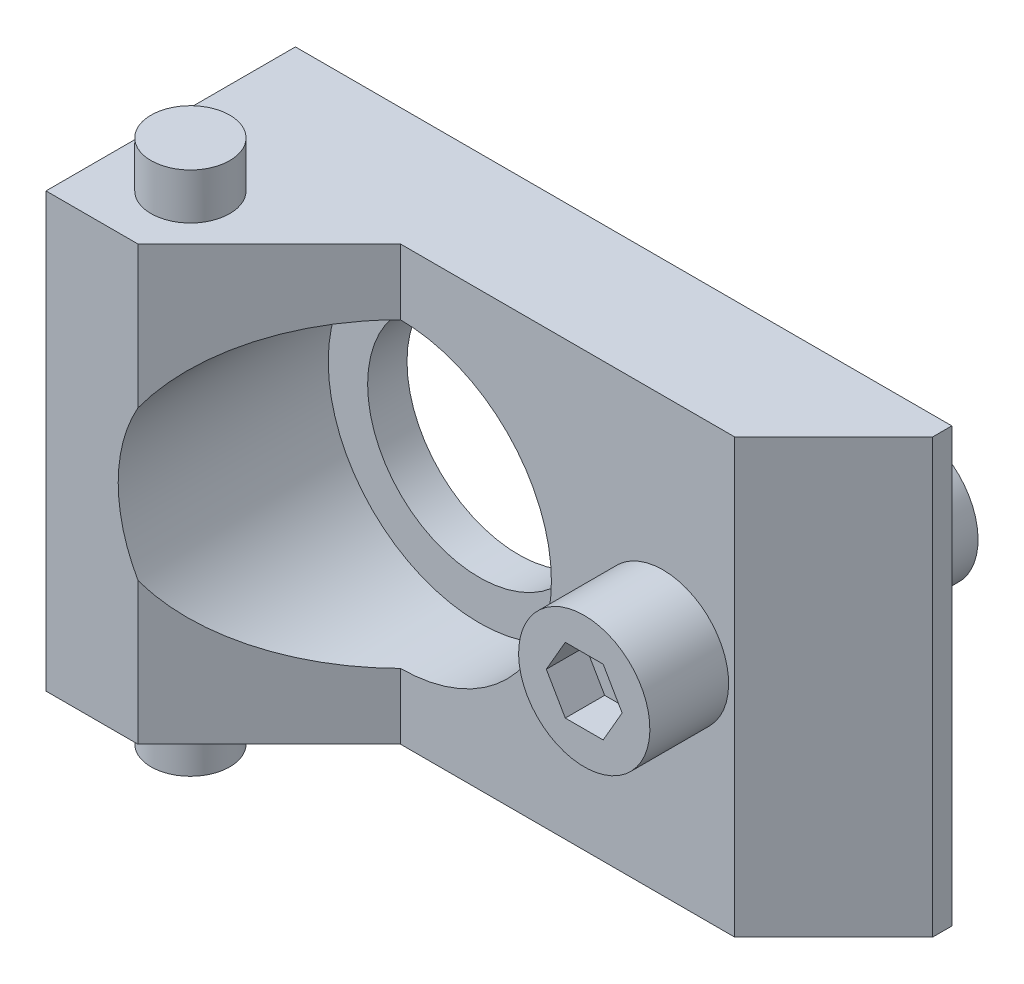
ISO-10303-21;
HEADER;
FILE_DESCRIPTION(('STEP AP214'),'2;1');
FILE_NAME('part.step','',(''),(''),'','','');
FILE_SCHEMA(('AUTOMOTIVE_DESIGN { 1 0 10303 214 1 1 1 1 }'));
ENDSEC;
DATA;
#1=APPLICATION_CONTEXT('core data for automotive mechanical design processes');
#2=APPLICATION_PROTOCOL_DEFINITION('international standard','automotive_design',2000,#1);
#3=PRODUCT_CONTEXT('',#1,'mechanical');
#4=PRODUCT('Part','Part','',(#3));
#5=PRODUCT_RELATED_PRODUCT_CATEGORY('part','',(#4));
#6=PRODUCT_DEFINITION_FORMATION('','',#4);
#7=PRODUCT_DEFINITION_CONTEXT('part definition',#1,'design');
#8=PRODUCT_DEFINITION('design','',#6,#7);
#9=PRODUCT_DEFINITION_SHAPE('','',#8);
#10=(LENGTH_UNIT() NAMED_UNIT(*) SI_UNIT(.MILLI.,.METRE.));
#11=(NAMED_UNIT(*) PLANE_ANGLE_UNIT() SI_UNIT($,.RADIAN.));
#12=(NAMED_UNIT(*) SI_UNIT($,.STERADIAN.) SOLID_ANGLE_UNIT());
#13=UNCERTAINTY_MEASURE_WITH_UNIT(LENGTH_MEASURE(1.E-05),#10,'distance_accuracy_value','');
#14=(GEOMETRIC_REPRESENTATION_CONTEXT(3) GLOBAL_UNCERTAINTY_ASSIGNED_CONTEXT((#13)) GLOBAL_UNIT_ASSIGNED_CONTEXT((#10,
#11,#12)) REPRESENTATION_CONTEXT('',''));
#15=CARTESIAN_POINT('',(0.,0.,0.));
#16=DIRECTION('',(0.,0.,1.));
#17=DIRECTION('',(1.,0.,0.));
#18=AXIS2_PLACEMENT_3D('',#15,#16,#17);
#19=CARTESIAN_POINT('',(0.,0.,5.));
#20=DIRECTION('',(0.,0.,-1.));
#21=DIRECTION('',(0.,-1.,0.));
#22=AXIS2_PLACEMENT_3D('',#19,#20,#21);
#23=CYLINDRICAL_SURFACE('',#22,5.);
#24=CARTESIAN_POINT('',(0.,0.,-10.));
#25=DIRECTION('',(0.,0.,-1.));
#26=DIRECTION('',(-1.,0.,0.));
#27=AXIS2_PLACEMENT_3D('',#24,#25,#26);
#28=CIRCLE('',#27,5.);
#29=CARTESIAN_POINT('',(-5.,0.,-10.));
#30=VERTEX_POINT('',#29);
#31=EDGE_CURVE('E21',#30,#30,#28,.T.);
#32=ORIENTED_EDGE('',*,*,#31,.F.);
#33=EDGE_LOOP('',(#32));
#34=FACE_BOUND('',#33,.T.);
#35=CARTESIAN_POINT('',(0.,0.,0.));
#36=DIRECTION('',(0.,0.,1.));
#37=DIRECTION('',(0.,-1.,0.));
#38=AXIS2_PLACEMENT_3D('',#35,#36,#37);
#39=CIRCLE('',#38,5.);
#40=CARTESIAN_POINT('',(0.,-5.,0.));
#41=VERTEX_POINT('',#40);
#42=EDGE_CURVE('E9',#41,#41,#39,.T.);
#43=ORIENTED_EDGE('',*,*,#42,.F.);
#44=EDGE_LOOP('',(#43));
#45=FACE_BOUND('',#44,.T.);
#46=ADVANCED_FACE('F14',(#34,#45),#23,.T.);
#47=CARTESIAN_POINT('',(0.,0.,-10.));
#48=DIRECTION('',(0.,0.,1.));
#49=DIRECTION('',(0.,1.,0.));
#50=AXIS2_PLACEMENT_3D('',#47,#48,#49);
#51=PLANE('',#50);
#52=ORIENTED_EDGE('',*,*,#31,.T.);
#53=EDGE_LOOP('',(#52));
#54=FACE_BOUND('',#53,.T.);
#55=ADVANCED_FACE('F226',(#54),#51,.F.);
#56=CARTESIAN_POINT('',(-1.44337567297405,2.5,12.));
#57=DIRECTION('',(0.,0.,1.));
#58=DIRECTION('',(0.,1.,0.));
#59=AXIS2_PLACEMENT_3D('',#56,#57,#58);
#60=PLANE('',#59);
#61=DIRECTION('',(0.5,0.866025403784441,0.));
#62=VECTOR('',#61,1.);
#63=CARTESIAN_POINT('',(-2.8867513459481,0.,12.));
#64=LINE('',#63,#62);
#65=CARTESIAN_POINT('',(-2.8867513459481,0.,12.));
#66=VERTEX_POINT('',#65);
#67=CARTESIAN_POINT('',(-1.44337567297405,2.5,12.));
#68=VERTEX_POINT('',#67);
#69=EDGE_CURVE('E177',#66,#68,#64,.T.);
#70=ORIENTED_EDGE('',*,*,#69,.F.);
#71=DIRECTION('',(0.5,-0.866025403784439,0.));
#72=VECTOR('',#71,1.);
#73=CARTESIAN_POINT('',(-2.8867513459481,0.,12.));
#74=LINE('',#73,#72);
#75=CARTESIAN_POINT('',(-1.44337567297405,-2.5,12.));
#76=VERTEX_POINT('',#75);
#77=EDGE_CURVE('E191',#66,#76,#74,.T.);
#78=ORIENTED_EDGE('',*,*,#77,.T.);
#79=DIRECTION('',(1.,0.,0.));
#80=VECTOR('',#79,1.);
#81=CARTESIAN_POINT('',(-1.44337567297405,-2.5,12.));
#82=LINE('',#81,#80);
#83=CARTESIAN_POINT('',(1.44337567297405,-2.5,12.));
#84=VERTEX_POINT('',#83);
#85=EDGE_CURVE('E194',#76,#84,#82,.T.);
#86=ORIENTED_EDGE('',*,*,#85,.T.);
#87=DIRECTION('',(-0.5,-0.866025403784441,0.));
#88=VECTOR('',#87,1.);
#89=CARTESIAN_POINT('',(2.88675134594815,0.,12.));
#90=LINE('',#89,#88);
#91=CARTESIAN_POINT('',(2.88675134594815,0.,12.));
#92=VERTEX_POINT('',#91);
#93=EDGE_CURVE('E197',#92,#84,#90,.T.);
#94=ORIENTED_EDGE('',*,*,#93,.F.);
#95=DIRECTION('',(-0.5,0.866025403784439,0.));
#96=VECTOR('',#95,1.);
#97=CARTESIAN_POINT('',(2.88675134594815,0.,12.));
#98=LINE('',#97,#96);
#99=CARTESIAN_POINT('',(1.44337567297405,2.5,12.));
#100=VERTEX_POINT('',#99);
#101=EDGE_CURVE('E200',#92,#100,#98,.T.);
#102=ORIENTED_EDGE('',*,*,#101,.T.);
#103=DIRECTION('',(-1.,0.,0.));
#104=VECTOR('',#103,1.);
#105=CARTESIAN_POINT('',(1.44337567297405,2.5,12.));
#106=LINE('',#105,#104);
#107=EDGE_CURVE('E203',#100,#68,#106,.T.);
#108=ORIENTED_EDGE('',*,*,#107,.T.);
#109=EDGE_LOOP('',(#70,#78,#86,#94,#102,#108));
#110=FACE_BOUND('',#109,.T.);
#111=ADVANCED_FACE('F249',(#110),#60,.T.);
#112=CARTESIAN_POINT('',(-1.44337567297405,-2.5,12.));
#113=DIRECTION('',(0.,-1.,0.));
#114=DIRECTION('',(1.,0.,0.));
#115=AXIS2_PLACEMENT_3D('',#112,#113,#114);
#116=PLANE('',#115);
#117=DIRECTION('',(0.,0.,1.));
#118=VECTOR('',#117,1.);
#119=CARTESIAN_POINT('',(-1.44337567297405,-2.5,12.));
#120=LINE('',#119,#118);
#121=CARTESIAN_POINT('',(-1.44337567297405,-2.5,15.));
#122=VERTEX_POINT('',#121);
#123=EDGE_CURVE('E208',#76,#122,#120,.T.);
#124=ORIENTED_EDGE('',*,*,#123,.T.);
#125=DIRECTION('',(1.,0.,0.));
#126=VECTOR('',#125,1.);
#127=CARTESIAN_POINT('',(-1.44337567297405,-2.5,15.));
#128=LINE('',#127,#126);
#129=CARTESIAN_POINT('',(1.44337567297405,-2.5,15.));
#130=VERTEX_POINT('',#129);
#131=EDGE_CURVE('E178',#122,#130,#128,.T.);
#132=ORIENTED_EDGE('',*,*,#131,.T.);
#133=DIRECTION('',(0.,0.,1.));
#134=VECTOR('',#133,1.);
#135=CARTESIAN_POINT('',(1.44337567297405,-2.5,12.));
#136=LINE('',#135,#134);
#137=EDGE_CURVE('E210',#84,#130,#136,.T.);
#138=ORIENTED_EDGE('',*,*,#137,.F.);
#139=ORIENTED_EDGE('',*,*,#85,.F.);
#140=EDGE_LOOP('',(#124,#132,#138,#139));
#141=FACE_BOUND('',#140,.T.);
#142=ADVANCED_FACE('F251',(#141),#116,.F.);
#143=CARTESIAN_POINT('',(2.88675134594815,0.,12.));
#144=DIRECTION('',(-0.866025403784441,0.5,0.));
#145=DIRECTION('',(-0.5,-0.866025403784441,0.));
#146=AXIS2_PLACEMENT_3D('',#143,#144,#145);
#147=PLANE('',#146);
#148=ORIENTED_EDGE('',*,*,#137,.T.);
#149=DIRECTION('',(-0.5,-0.866025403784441,0.));
#150=VECTOR('',#149,1.);
#151=CARTESIAN_POINT('',(2.88675134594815,0.,15.));
#152=LINE('',#151,#150);
#153=CARTESIAN_POINT('',(2.88675134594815,0.,15.));
#154=VERTEX_POINT('',#153);
#155=EDGE_CURVE('E181',#154,#130,#152,.T.);
#156=ORIENTED_EDGE('',*,*,#155,.F.);
#157=DIRECTION('',(0.,0.,1.));
#158=VECTOR('',#157,1.);
#159=CARTESIAN_POINT('',(2.88675134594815,0.,12.));
#160=LINE('',#159,#158);
#161=EDGE_CURVE('E212',#92,#154,#160,.T.);
#162=ORIENTED_EDGE('',*,*,#161,.F.);
#163=ORIENTED_EDGE('',*,*,#93,.T.);
#164=EDGE_LOOP('',(#148,#156,#162,#163));
#165=FACE_BOUND('',#164,.T.);
#166=ADVANCED_FACE('F259',(#165),#147,.T.);
#167=CARTESIAN_POINT('',(2.88675134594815,0.,12.));
#168=DIRECTION('',(0.866025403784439,0.5,0.));
#169=DIRECTION('',(-0.5,0.866025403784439,0.));
#170=AXIS2_PLACEMENT_3D('',#167,#168,#169);
#171=PLANE('',#170);
#172=ORIENTED_EDGE('',*,*,#161,.T.);
#173=DIRECTION('',(-0.5,0.866025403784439,0.));
#174=VECTOR('',#173,1.);
#175=CARTESIAN_POINT('',(2.88675134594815,0.,15.));
#176=LINE('',#175,#174);
#177=CARTESIAN_POINT('',(1.44337567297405,2.5,15.));
#178=VERTEX_POINT('',#177);
#179=EDGE_CURVE('E184',#154,#178,#176,.T.);
#180=ORIENTED_EDGE('',*,*,#179,.T.);
#181=DIRECTION('',(0.,0.,1.));
#182=VECTOR('',#181,1.);
#183=CARTESIAN_POINT('',(1.44337567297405,2.5,12.));
#184=LINE('',#183,#182);
#185=EDGE_CURVE('E214',#100,#178,#184,.T.);
#186=ORIENTED_EDGE('',*,*,#185,.F.);
#187=ORIENTED_EDGE('',*,*,#101,.F.);
#188=EDGE_LOOP('',(#172,#180,#186,#187));
#189=FACE_BOUND('',#188,.T.);
#190=ADVANCED_FACE('F277',(#189),#171,.F.);
#191=CARTESIAN_POINT('',(1.44337567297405,2.5,12.));
#192=DIRECTION('',(0.,1.,0.));
#193=DIRECTION('',(-1.,0.,0.));
#194=AXIS2_PLACEMENT_3D('',#191,#192,#193);
#195=PLANE('',#194);
#196=ORIENTED_EDGE('',*,*,#185,.T.);
#197=DIRECTION('',(-1.,0.,0.));
#198=VECTOR('',#197,1.);
#199=CARTESIAN_POINT('',(1.44337567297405,2.5,15.));
#200=LINE('',#199,#198);
#201=CARTESIAN_POINT('',(-1.44337567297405,2.5,15.));
#202=VERTEX_POINT('',#201);
#203=EDGE_CURVE('E187',#178,#202,#200,.T.);
#204=ORIENTED_EDGE('',*,*,#203,.T.);
#205=DIRECTION('',(0.,0.,1.));
#206=VECTOR('',#205,1.);
#207=CARTESIAN_POINT('',(-1.44337567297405,2.5,12.));
#208=LINE('',#207,#206);
#209=EDGE_CURVE('E216',#68,#202,#208,.T.);
#210=ORIENTED_EDGE('',*,*,#209,.F.);
#211=ORIENTED_EDGE('',*,*,#107,.F.);
#212=EDGE_LOOP('',(#196,#204,#210,#211));
#213=FACE_BOUND('',#212,.T.);
#214=ADVANCED_FACE('F270',(#213),#195,.F.);
#215=CARTESIAN_POINT('',(-2.8867513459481,0.,12.));
#216=DIRECTION('',(0.866025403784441,-0.5,0.));
#217=DIRECTION('',(0.5,0.866025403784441,0.));
#218=AXIS2_PLACEMENT_3D('',#215,#216,#217);
#219=PLANE('',#218);
#220=ORIENTED_EDGE('',*,*,#209,.T.);
#221=DIRECTION('',(0.5,0.866025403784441,0.));
#222=VECTOR('',#221,1.);
#223=CARTESIAN_POINT('',(-2.8867513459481,0.,15.));
#224=LINE('',#223,#222);
#225=CARTESIAN_POINT('',(-2.8867513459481,0.,15.));
#226=VERTEX_POINT('',#225);
#227=EDGE_CURVE('E28',#226,#202,#224,.T.);
#228=ORIENTED_EDGE('',*,*,#227,.F.);
#229=DIRECTION('',(0.,0.,1.));
#230=VECTOR('',#229,1.);
#231=CARTESIAN_POINT('',(-2.8867513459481,0.,12.));
#232=LINE('',#231,#230);
#233=EDGE_CURVE('E32',#66,#226,#232,.T.);
#234=ORIENTED_EDGE('',*,*,#233,.F.);
#235=ORIENTED_EDGE('',*,*,#69,.T.);
#236=EDGE_LOOP('',(#220,#228,#234,#235));
#237=FACE_BOUND('',#236,.T.);
#238=ADVANCED_FACE('F266',(#237),#219,.T.);
#239=CARTESIAN_POINT('',(-2.8867513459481,0.,12.));
#240=DIRECTION('',(-0.866025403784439,-0.5,0.));
#241=DIRECTION('',(0.5,-0.866025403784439,0.));
#242=AXIS2_PLACEMENT_3D('',#239,#240,#241);
#243=PLANE('',#242);
#244=ORIENTED_EDGE('',*,*,#77,.F.);
#245=ORIENTED_EDGE('',*,*,#233,.T.);
#246=DIRECTION('',(0.5,-0.866025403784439,0.));
#247=VECTOR('',#246,1.);
#248=CARTESIAN_POINT('',(-2.8867513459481,0.,15.));
#249=LINE('',#248,#247);
#250=EDGE_CURVE('E174',#226,#122,#249,.T.);
#251=ORIENTED_EDGE('',*,*,#250,.T.);
#252=ORIENTED_EDGE('',*,*,#123,.F.);
#253=EDGE_LOOP('',(#244,#245,#251,#252));
#254=FACE_BOUND('',#253,.T.);
#255=ADVANCED_FACE('F269',(#254),#243,.F.);
#256=CARTESIAN_POINT('',(0.,0.,15.));
#257=DIRECTION('',(0.,0.,1.));
#258=DIRECTION('',(0.,1.,0.));
#259=AXIS2_PLACEMENT_3D('',#256,#257,#258);
#260=PLANE('',#259);
#261=CARTESIAN_POINT('',(0.,0.,15.));
#262=DIRECTION('',(0.,0.,1.));
#263=DIRECTION('',(0.,1.,0.));
#264=AXIS2_PLACEMENT_3D('',#261,#262,#263);
#265=CIRCLE('',#264,5.);
#266=CARTESIAN_POINT('',(0.,5.,15.));
#267=VERTEX_POINT('',#266);
#268=EDGE_CURVE('E221',#267,#267,#265,.T.);
#269=ORIENTED_EDGE('',*,*,#268,.T.);
#270=EDGE_LOOP('',(#269));
#271=FACE_BOUND('',#270,.T.);
#272=ORIENTED_EDGE('',*,*,#250,.F.);
#273=ORIENTED_EDGE('',*,*,#227,.T.);
#274=ORIENTED_EDGE('',*,*,#203,.F.);
#275=ORIENTED_EDGE('',*,*,#179,.F.);
#276=ORIENTED_EDGE('',*,*,#155,.T.);
#277=ORIENTED_EDGE('',*,*,#131,.F.);
#278=EDGE_LOOP('',(#272,#273,#274,#275,#276,#277));
#279=FACE_BOUND('',#278,.T.);
#280=ADVANCED_FACE('F272',(#271,#279),#260,.T.);
#281=CARTESIAN_POINT('',(-31.5,20.,13.5));
#282=DIRECTION('',(0.,-1.,0.));
#283=DIRECTION('',(0.381849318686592,0.,0.924224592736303));
#284=AXIS2_PLACEMENT_3D('',#281,#282,#283);
#285=PLANE('',#284);
#286=CARTESIAN_POINT('',(-31.5,20.,13.5));
#287=DIRECTION('',(0.,-1.,0.));
#288=DIRECTION('',(0.381849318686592,0.,0.924224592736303));
#289=AXIS2_PLACEMENT_3D('',#286,#287,#288);
#290=CIRCLE('',#289,3.);
#291=CARTESIAN_POINT('',(-30.3544520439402,20.,16.2726737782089));
#292=VERTEX_POINT('',#291);
#293=EDGE_CURVE('E168',#292,#292,#290,.T.);
#294=ORIENTED_EDGE('',*,*,#293,.F.);
#295=EDGE_LOOP('',(#294));
#296=FACE_BOUND('',#295,.T.);
#297=ADVANCED_FACE('F292',(#296),#285,.F.);
#298=CARTESIAN_POINT('',(-31.5,-20.,13.5));
#299=DIRECTION('',(0.,-1.,0.));
#300=DIRECTION('',(0.860899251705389,0.,0.508775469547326));
#301=AXIS2_PLACEMENT_3D('',#298,#299,#300);
#302=PLANE('',#301);
#303=CARTESIAN_POINT('',(-31.5,-20.,13.5));
#304=DIRECTION('',(0.,-1.,0.));
#305=DIRECTION('',(0.860899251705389,0.,0.508775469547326));
#306=AXIS2_PLACEMENT_3D('',#303,#304,#305);
#307=CIRCLE('',#306,3.);
#308=CARTESIAN_POINT('',(-28.9173022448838,-20.,15.026326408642));
#309=VERTEX_POINT('',#308);
#310=EDGE_CURVE('E129',#309,#309,#307,.T.);
#311=ORIENTED_EDGE('',*,*,#310,.T.);
#312=EDGE_LOOP('',(#311));
#313=FACE_BOUND('',#312,.T.);
#314=ADVANCED_FACE('F289',(#313),#302,.T.);
#315=CARTESIAN_POINT('',(0.,0.,17.));
#316=DIRECTION('',(0.,0.,1.));
#317=DIRECTION('',(0.,1.,0.));
#318=AXIS2_PLACEMENT_3D('',#315,#316,#317);
#319=CYLINDRICAL_SURFACE('',#318,5.);
#320=CARTESIAN_POINT('',(0.,0.,9.));
#321=DIRECTION('',(0.,0.,1.));
#322=DIRECTION('',(0.,1.,0.));
#323=AXIS2_PLACEMENT_3D('',#320,#321,#322);
#324=CIRCLE('',#323,5.);
#325=CARTESIAN_POINT('',(0.,5.,9.));
#326=VERTEX_POINT('',#325);
#327=EDGE_CURVE('E218',#326,#326,#324,.T.);
#328=ORIENTED_EDGE('',*,*,#327,.T.);
#329=EDGE_LOOP('',(#328));
#330=FACE_BOUND('',#329,.T.);
#331=ORIENTED_EDGE('',*,*,#268,.F.);
#332=EDGE_LOOP('',(#331));
#333=FACE_BOUND('',#332,.T.);
#334=ADVANCED_FACE('F285',(#330,#333),#319,.T.);
#335=CARTESIAN_POINT('',(-20.,0.,3.));
#336=DIRECTION('',(0.,0.,1.));
#337=DIRECTION('',(-1.,0.,0.));
#338=AXIS2_PLACEMENT_3D('',#335,#336,#337);
#339=CYLINDRICAL_SURFACE('',#338,11.5);
#340=CARTESIAN_POINT('',(-20.,0.,3.));
#341=DIRECTION('',(0.,0.,1.));
#342=DIRECTION('',(-1.,0.,0.));
#343=AXIS2_PLACEMENT_3D('',#340,#341,#342);
#344=CIRCLE('',#343,11.5);
#345=CARTESIAN_POINT('',(-31.5,0.,3.));
#346=VERTEX_POINT('',#345);
#347=EDGE_CURVE('E157',#346,#346,#344,.T.);
#348=ORIENTED_EDGE('',*,*,#347,.F.);
#349=EDGE_LOOP('',(#348));
#350=FACE_BOUND('',#349,.T.);
#351=CARTESIAN_POINT('',(-20.,0.,19.));
#352=DIRECTION('',(0.,0.,1.));
#353=DIRECTION('',(-1.,0.,0.));
#354=AXIS2_PLACEMENT_3D('',#351,#352,#353);
#355=CIRCLE('',#354,11.5);
#356=CARTESIAN_POINT('',(-30.,-5.67890834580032,19.));
#357=VERTEX_POINT('',#356);
#358=CARTESIAN_POINT('',(-30.,5.67890834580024,19.));
#359=VERTEX_POINT('',#358);
#360=EDGE_CURVE('E416',#357,#359,#355,.F.);
#361=ORIENTED_EDGE('',*,*,#360,.F.);
#362=CARTESIAN_POINT('',(-20.,0.,9.00000000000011));
#363=DIRECTION('',(-0.707106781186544,0.,-0.707106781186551));
#364=DIRECTION('',(-0.707106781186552,0.,0.707106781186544));
#365=AXIS2_PLACEMENT_3D('',#362,#363,#364);
#366=ELLIPSE('',#365,16.2634559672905,11.5);
#367=CARTESIAN_POINT('',(-20.,-11.5,9.));
#368=VERTEX_POINT('',#367);
#369=EDGE_CURVE('E163',#357,#368,#366,.F.);
#370=ORIENTED_EDGE('',*,*,#369,.T.);
#371=CARTESIAN_POINT('',(-20.,0.,9.));
#372=DIRECTION('',(0.,0.,-1.));
#373=DIRECTION('',(1.,0.,0.));
#374=AXIS2_PLACEMENT_3D('',#371,#372,#373);
#375=CIRCLE('',#374,11.5);
#376=CARTESIAN_POINT('',(-20.,11.5,9.));
#377=VERTEX_POINT('',#376);
#378=EDGE_CURVE('E147',#368,#377,#375,.F.);
#379=ORIENTED_EDGE('',*,*,#378,.T.);
#380=EDGE_CURVE('E160',#377,#359,#366,.F.);
#381=ORIENTED_EDGE('',*,*,#380,.T.);
#382=EDGE_LOOP('',(#361,#370,#379,#381));
#383=FACE_BOUND('',#382,.T.);
#384=ADVANCED_FACE('F288',(#350,#383),#339,.F.);
#385=CARTESIAN_POINT('',(-20.,0.,3.));
#386=DIRECTION('',(0.,0.,1.));
#387=DIRECTION('',(-1.,0.,0.));
#388=AXIS2_PLACEMENT_3D('',#385,#386,#387);
#389=PLANE('',#388);
#390=ORIENTED_EDGE('',*,*,#347,.T.);
#391=EDGE_LOOP('',(#390));
#392=FACE_BOUND('',#391,.T.);
#393=CARTESIAN_POINT('',(-20.,0.,3.));
#394=DIRECTION('',(0.,0.,1.));
#395=DIRECTION('',(-1.,0.,0.));
#396=AXIS2_PLACEMENT_3D('',#393,#394,#395);
#397=CIRCLE('',#396,8.5);
#398=CARTESIAN_POINT('',(-28.5,0.,3.));
#399=VERTEX_POINT('',#398);
#400=EDGE_CURVE('E153',#399,#399,#397,.F.);
#401=ORIENTED_EDGE('',*,*,#400,.T.);
#402=EDGE_LOOP('',(#401));
#403=FACE_BOUND('',#402,.T.);
#404=ADVANCED_FACE('F359',(#392,#403),#389,.T.);
#405=CARTESIAN_POINT('',(-31.5,10.,13.5));
#406=DIRECTION('',(0.,1.,0.));
#407=DIRECTION('',(-0.381849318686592,0.,-0.924224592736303));
#408=AXIS2_PLACEMENT_3D('',#405,#406,#407);
#409=CYLINDRICAL_SURFACE('',#408,3.);
#410=ORIENTED_EDGE('',*,*,#293,.T.);
#411=EDGE_LOOP('',(#410));
#412=FACE_BOUND('',#411,.T.);
#413=CARTESIAN_POINT('',(-31.5,16.5,13.5));
#414=DIRECTION('',(0.,-1.,0.));
#415=DIRECTION('',(0.,0.,-1.));
#416=AXIS2_PLACEMENT_3D('',#413,#414,#415);
#417=CIRCLE('',#416,3.);
#418=CARTESIAN_POINT('',(-31.5,16.5,10.5));
#419=VERTEX_POINT('',#418);
#420=EDGE_CURVE('E171',#419,#419,#417,.T.);
#421=ORIENTED_EDGE('',*,*,#420,.F.);
#422=EDGE_LOOP('',(#421));
#423=FACE_BOUND('',#422,.T.);
#424=ADVANCED_FACE('F264',(#412,#423),#409,.T.);
#425=CARTESIAN_POINT('',(-31.,-16.5,20.));
#426=DIRECTION('',(-0.707106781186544,0.,-0.707106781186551));
#427=DIRECTION('',(0.707106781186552,0.,-0.707106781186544));
#428=AXIS2_PLACEMENT_3D('',#425,#426,#427);
#429=PLANE('',#428);
#430=DIRECTION('',(0.,1.,0.));
#431=VECTOR('',#430,1.);
#432=CARTESIAN_POINT('',(-30.,-16.5,19.));
#433=LINE('',#432,#431);
#434=CARTESIAN_POINT('',(-30.,16.5,19.));
#435=VERTEX_POINT('',#434);
#436=EDGE_CURVE('E124',#359,#435,#433,.T.);
#437=ORIENTED_EDGE('',*,*,#436,.F.);
#438=ORIENTED_EDGE('',*,*,#380,.F.);
#439=DIRECTION('',(0.,1.,0.));
#440=VECTOR('',#439,1.);
#441=CARTESIAN_POINT('',(-20.,-16.5,9.));
#442=LINE('',#441,#440);
#443=CARTESIAN_POINT('',(-20.,16.5,9.));
#444=VERTEX_POINT('',#443);
#445=EDGE_CURVE('E410',#377,#444,#442,.T.);
#446=ORIENTED_EDGE('',*,*,#445,.T.);
#447=DIRECTION('',(-0.707106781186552,0.,0.707106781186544));
#448=VECTOR('',#447,1.);
#449=CARTESIAN_POINT('',(-31.,16.5,20.));
#450=LINE('',#449,#448);
#451=EDGE_CURVE('E397',#444,#435,#450,.T.);
#452=ORIENTED_EDGE('',*,*,#451,.T.);
#453=EDGE_LOOP('',(#437,#438,#446,#452));
#454=FACE_BOUND('',#453,.T.);
#455=ADVANCED_FACE('F336',(#454),#429,.F.);
#456=CARTESIAN_POINT('',(-31.5,-20.,13.5));
#457=DIRECTION('',(0.,1.,0.));
#458=DIRECTION('',(-0.860899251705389,0.,-0.508775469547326));
#459=AXIS2_PLACEMENT_3D('',#456,#457,#458);
#460=CYLINDRICAL_SURFACE('',#459,3.);
#461=ORIENTED_EDGE('',*,*,#310,.F.);
#462=EDGE_LOOP('',(#461));
#463=FACE_BOUND('',#462,.T.);
#464=CARTESIAN_POINT('',(-31.5,-16.5,13.5));
#465=DIRECTION('',(0.,1.,0.));
#466=DIRECTION('',(-1.,0.,0.));
#467=AXIS2_PLACEMENT_3D('',#464,#465,#466);
#468=CIRCLE('',#467,3.);
#469=CARTESIAN_POINT('',(-34.5,-16.5,13.5));
#470=VERTEX_POINT('',#469);
#471=EDGE_CURVE('E165',#470,#470,#468,.F.);
#472=ORIENTED_EDGE('',*,*,#471,.T.);
#473=EDGE_LOOP('',(#472));
#474=FACE_BOUND('',#473,.T.);
#475=ADVANCED_FACE('F333',(#463,#474),#460,.T.);
#476=DIRECTION('',(0.,1.,0.));
#477=VECTOR('',#476,1.);
#478=CARTESIAN_POINT('',(-30.,-16.5,19.));
#479=LINE('',#478,#477);
#480=CARTESIAN_POINT('',(-30.,-16.5,19.));
#481=VERTEX_POINT('',#480);
#482=EDGE_CURVE('E421',#481,#357,#479,.T.);
#483=ORIENTED_EDGE('',*,*,#482,.F.);
#484=DIRECTION('',(-0.707106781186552,0.,0.707106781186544));
#485=VECTOR('',#484,1.);
#486=CARTESIAN_POINT('',(-31.,-16.5,20.));
#487=LINE('',#486,#485);
#488=CARTESIAN_POINT('',(-20.,-16.5,9.));
#489=VERTEX_POINT('',#488);
#490=EDGE_CURVE('E399',#489,#481,#487,.T.);
#491=ORIENTED_EDGE('',*,*,#490,.F.);
#492=EDGE_CURVE('E407',#489,#368,#442,.T.);
#493=ORIENTED_EDGE('',*,*,#492,.T.);
#494=ORIENTED_EDGE('',*,*,#369,.F.);
#495=EDGE_LOOP('',(#483,#491,#493,#494));
#496=FACE_BOUND('',#495,.T.);
#497=ADVANCED_FACE('F335',(#496),#429,.F.);
#498=CARTESIAN_POINT('',(5.45584412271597,-16.5,9.));
#499=DIRECTION('',(0.,0.,-1.));
#500=DIRECTION('',(1.,0.,0.));
#501=AXIS2_PLACEMENT_3D('',#498,#499,#500);
#502=PLANE('',#501);
#503=ORIENTED_EDGE('',*,*,#327,.F.);
#504=EDGE_LOOP('',(#503));
#505=FACE_BOUND('',#504,.T.);
#506=ORIENTED_EDGE('',*,*,#492,.F.);
#507=DIRECTION('',(-1.,0.,0.));
#508=VECTOR('',#507,1.);
#509=CARTESIAN_POINT('',(5.45584412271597,-16.5,9.));
#510=LINE('',#509,#508);
#511=CARTESIAN_POINT('',(5.45584412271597,-16.5,9.));
#512=VERTEX_POINT('',#511);
#513=EDGE_CURVE('E396',#512,#489,#510,.T.);
#514=ORIENTED_EDGE('',*,*,#513,.F.);
#515=DIRECTION('',(0.,1.,0.));
#516=VECTOR('',#515,1.);
#517=CARTESIAN_POINT('',(5.45584412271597,-16.5,9.));
#518=LINE('',#517,#516);
#519=CARTESIAN_POINT('',(5.45584412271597,16.5,9.));
#520=VERTEX_POINT('',#519);
#521=EDGE_CURVE('E406',#512,#520,#518,.T.);
#522=ORIENTED_EDGE('',*,*,#521,.T.);
#523=DIRECTION('',(-1.,0.,0.));
#524=VECTOR('',#523,1.);
#525=CARTESIAN_POINT('',(5.45584412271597,16.5,9.));
#526=LINE('',#525,#524);
#527=EDGE_CURVE('E401',#520,#444,#526,.T.);
#528=ORIENTED_EDGE('',*,*,#527,.T.);
#529=ORIENTED_EDGE('',*,*,#445,.F.);
#530=ORIENTED_EDGE('',*,*,#378,.F.);
#531=EDGE_LOOP('',(#506,#514,#522,#528,#529,#530));
#532=FACE_BOUND('',#531,.T.);
#533=ADVANCED_FACE('F344',(#505,#532),#502,.F.);
#534=CARTESIAN_POINT('',(-37.,16.5,19.));
#535=DIRECTION('',(0.,0.,1.));
#536=DIRECTION('',(-1.,0.,0.));
#537=AXIS2_PLACEMENT_3D('',#534,#535,#536);
#538=PLANE('',#537);
#539=ORIENTED_EDGE('',*,*,#360,.T.);
#540=ORIENTED_EDGE('',*,*,#436,.T.);
#541=DIRECTION('',(-1.,0.,0.));
#542=VECTOR('',#541,1.);
#543=CARTESIAN_POINT('',(-30.,16.5,19.));
#544=LINE('',#543,#542);
#545=CARTESIAN_POINT('',(-37.,16.5,19.));
#546=VERTEX_POINT('',#545);
#547=EDGE_CURVE('E118',#435,#546,#544,.T.);
#548=ORIENTED_EDGE('',*,*,#547,.T.);
#549=DIRECTION('',(0.,-1.,0.));
#550=VECTOR('',#549,1.);
#551=CARTESIAN_POINT('',(-37.,16.5,19.));
#552=LINE('',#551,#550);
#553=CARTESIAN_POINT('',(-37.,-16.5,19.));
#554=VERTEX_POINT('',#553);
#555=EDGE_CURVE('E121',#546,#554,#552,.T.);
#556=ORIENTED_EDGE('',*,*,#555,.T.);
#557=DIRECTION('',(1.,0.,0.));
#558=VECTOR('',#557,1.);
#559=CARTESIAN_POINT('',(-37.,-16.5,19.));
#560=LINE('',#559,#558);
#561=EDGE_CURVE('E138',#554,#481,#560,.T.);
#562=ORIENTED_EDGE('',*,*,#561,.T.);
#563=ORIENTED_EDGE('',*,*,#482,.T.);
#564=EDGE_LOOP('',(#539,#540,#548,#556,#562,#563));
#565=FACE_BOUND('',#564,.T.);
#566=ADVANCED_FACE('F120',(#565),#538,.T.);
#567=CARTESIAN_POINT('',(5.45584412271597,-16.5,9.));
#568=DIRECTION('',(-0.707106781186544,0.,-0.707106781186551));
#569=DIRECTION('',(0.707106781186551,0.,-0.707106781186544));
#570=AXIS2_PLACEMENT_3D('',#567,#568,#569);
#571=PLANE('',#570);
#572=DIRECTION('',(-0.707106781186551,0.,0.707106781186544));
#573=VECTOR('',#572,1.);
#574=CARTESIAN_POINT('',(5.45584412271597,16.5,9.));
#575=LINE('',#574,#573);
#576=CARTESIAN_POINT('',(13.,16.5,1.45584412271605));
#577=VERTEX_POINT('',#576);
#578=EDGE_CURVE('E420',#577,#520,#575,.T.);
#579=ORIENTED_EDGE('',*,*,#578,.T.);
#580=ORIENTED_EDGE('',*,*,#521,.F.);
#581=DIRECTION('',(-0.707106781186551,0.,0.707106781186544));
#582=VECTOR('',#581,1.);
#583=CARTESIAN_POINT('',(5.45584412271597,-16.5,9.));
#584=LINE('',#583,#582);
#585=CARTESIAN_POINT('',(13.,-16.5,1.45584412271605));
#586=VERTEX_POINT('',#585);
#587=EDGE_CURVE('E394',#586,#512,#584,.T.);
#588=ORIENTED_EDGE('',*,*,#587,.F.);
#589=DIRECTION('',(0.,-1.,0.));
#590=VECTOR('',#589,1.);
#591=CARTESIAN_POINT('',(13.,-16.5,1.45584412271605));
#592=LINE('',#591,#590);
#593=EDGE_CURVE('E390',#577,#586,#592,.T.);
#594=ORIENTED_EDGE('',*,*,#593,.F.);
#595=EDGE_LOOP('',(#579,#580,#588,#594));
#596=FACE_BOUND('',#595,.T.);
#597=ADVANCED_FACE('F351',(#596),#571,.F.);
#598=CARTESIAN_POINT('',(-20.,0.,20.));
#599=DIRECTION('',(0.,0.,1.));
#600=DIRECTION('',(-1.,0.,0.));
#601=AXIS2_PLACEMENT_3D('',#598,#599,#600);
#602=CYLINDRICAL_SURFACE('',#601,8.5);
#603=CARTESIAN_POINT('',(-20.,0.,0.));
#604=DIRECTION('',(0.,0.,1.));
#605=DIRECTION('',(-1.,0.,0.));
#606=AXIS2_PLACEMENT_3D('',#603,#604,#605);
#607=CIRCLE('',#606,8.5);
#608=CARTESIAN_POINT('',(-28.5,0.,0.));
#609=VERTEX_POINT('',#608);
#610=EDGE_CURVE('E156',#609,#609,#607,.T.);
#611=ORIENTED_EDGE('',*,*,#610,.F.);
#612=EDGE_LOOP('',(#611));
#613=FACE_BOUND('',#612,.T.);
#614=ORIENTED_EDGE('',*,*,#400,.F.);
#615=EDGE_LOOP('',(#614));
#616=FACE_BOUND('',#615,.T.);
#617=ADVANCED_FACE('F322',(#613,#616),#602,.F.);
#618=CARTESIAN_POINT('',(13.,16.5,20.));
#619=DIRECTION('',(0.,-1.,0.));
#620=DIRECTION('',(1.,0.,0.));
#621=AXIS2_PLACEMENT_3D('',#618,#619,#620);
#622=PLANE('',#621);
#623=ORIENTED_EDGE('',*,*,#547,.F.);
#624=ORIENTED_EDGE('',*,*,#451,.F.);
#625=ORIENTED_EDGE('',*,*,#527,.F.);
#626=ORIENTED_EDGE('',*,*,#578,.F.);
#627=DIRECTION('',(0.,0.,-1.));
#628=VECTOR('',#627,1.);
#629=CARTESIAN_POINT('',(13.,16.5,20.));
#630=LINE('',#629,#628);
#631=CARTESIAN_POINT('',(13.,16.5,0.));
#632=VERTEX_POINT('',#631);
#633=EDGE_CURVE('E145',#577,#632,#630,.T.);
#634=ORIENTED_EDGE('',*,*,#633,.T.);
#635=DIRECTION('',(-1.,0.,0.));
#636=VECTOR('',#635,1.);
#637=CARTESIAN_POINT('',(13.,16.5,0.));
#638=LINE('',#637,#636);
#639=CARTESIAN_POINT('',(-37.,16.5,0.));
#640=VERTEX_POINT('',#639);
#641=EDGE_CURVE('E143',#632,#640,#638,.T.);
#642=ORIENTED_EDGE('',*,*,#641,.T.);
#643=DIRECTION('',(0.,0.,-1.));
#644=VECTOR('',#643,1.);
#645=CARTESIAN_POINT('',(-37.,16.5,20.));
#646=LINE('',#645,#644);
#647=EDGE_CURVE('E135',#546,#640,#646,.T.);
#648=ORIENTED_EDGE('',*,*,#647,.F.);
#649=EDGE_LOOP('',(#623,#624,#625,#626,#634,#642,#648));
#650=FACE_BOUND('',#649,.T.);
#651=ORIENTED_EDGE('',*,*,#420,.T.);
#652=EDGE_LOOP('',(#651));
#653=FACE_BOUND('',#652,.T.);
#654=ADVANCED_FACE('F140',(#650,#653),#622,.F.);
#655=CARTESIAN_POINT('',(-37.,-16.5,20.));
#656=DIRECTION('',(1.,0.,0.));
#657=DIRECTION('',(0.,0.,1.));
#658=AXIS2_PLACEMENT_3D('',#655,#656,#657);
#659=PLANE('',#658);
#660=ORIENTED_EDGE('',*,*,#555,.F.);
#661=ORIENTED_EDGE('',*,*,#647,.T.);
#662=DIRECTION('',(0.,-1.,0.));
#663=VECTOR('',#662,1.);
#664=CARTESIAN_POINT('',(-37.,-16.5,0.));
#665=LINE('',#664,#663);
#666=CARTESIAN_POINT('',(-37.,-16.5,0.));
#667=VERTEX_POINT('',#666);
#668=EDGE_CURVE('E383',#640,#667,#665,.T.);
#669=ORIENTED_EDGE('',*,*,#668,.T.);
#670=DIRECTION('',(0.,0.,-1.));
#671=VECTOR('',#670,1.);
#672=CARTESIAN_POINT('',(-37.,-16.5,20.));
#673=LINE('',#672,#671);
#674=EDGE_CURVE('E137',#554,#667,#673,.T.);
#675=ORIENTED_EDGE('',*,*,#674,.F.);
#676=EDGE_LOOP('',(#660,#661,#669,#675));
#677=FACE_BOUND('',#676,.T.);
#678=ADVANCED_FACE('F133',(#677),#659,.F.);
#679=CARTESIAN_POINT('',(13.,-16.5,20.));
#680=DIRECTION('',(0.,1.,0.));
#681=DIRECTION('',(-1.,0.,0.));
#682=AXIS2_PLACEMENT_3D('',#679,#680,#681);
#683=PLANE('',#682);
#684=ORIENTED_EDGE('',*,*,#561,.F.);
#685=ORIENTED_EDGE('',*,*,#674,.T.);
#686=DIRECTION('',(1.,0.,0.));
#687=VECTOR('',#686,1.);
#688=CARTESIAN_POINT('',(13.,-16.5,0.));
#689=LINE('',#688,#687);
#690=CARTESIAN_POINT('',(13.,-16.5,0.));
#691=VERTEX_POINT('',#690);
#692=EDGE_CURVE('E385',#667,#691,#689,.T.);
#693=ORIENTED_EDGE('',*,*,#692,.T.);
#694=DIRECTION('',(0.,0.,-1.));
#695=VECTOR('',#694,1.);
#696=CARTESIAN_POINT('',(13.,-16.5,20.));
#697=LINE('',#696,#695);
#698=EDGE_CURVE('E149',#586,#691,#697,.T.);
#699=ORIENTED_EDGE('',*,*,#698,.F.);
#700=ORIENTED_EDGE('',*,*,#587,.T.);
#701=ORIENTED_EDGE('',*,*,#513,.T.);
#702=ORIENTED_EDGE('',*,*,#490,.T.);
#703=EDGE_LOOP('',(#684,#685,#693,#699,#700,#701,#702));
#704=FACE_BOUND('',#703,.T.);
#705=ORIENTED_EDGE('',*,*,#471,.F.);
#706=EDGE_LOOP('',(#705));
#707=FACE_BOUND('',#706,.T.);
#708=ADVANCED_FACE('F242',(#704,#707),#683,.F.);
#709=CARTESIAN_POINT('',(13.,-16.5,20.));
#710=DIRECTION('',(-1.,0.,0.));
#711=DIRECTION('',(0.,0.,-1.));
#712=AXIS2_PLACEMENT_3D('',#709,#710,#711);
#713=PLANE('',#712);
#714=ORIENTED_EDGE('',*,*,#633,.F.);
#715=ORIENTED_EDGE('',*,*,#593,.T.);
#716=ORIENTED_EDGE('',*,*,#698,.T.);
#717=DIRECTION('',(0.,1.,0.));
#718=VECTOR('',#717,1.);
#719=CARTESIAN_POINT('',(13.,-16.5,0.));
#720=LINE('',#719,#718);
#721=EDGE_CURVE('E375',#691,#632,#720,.T.);
#722=ORIENTED_EDGE('',*,*,#721,.T.);
#723=EDGE_LOOP('',(#714,#715,#716,#722));
#724=FACE_BOUND('',#723,.T.);
#725=ADVANCED_FACE('F234',(#724),#713,.F.);
#726=CARTESIAN_POINT('',(13.,16.5,0.));
#727=DIRECTION('',(0.,0.,1.));
#728=DIRECTION('',(-1.,0.,0.));
#729=AXIS2_PLACEMENT_3D('',#726,#727,#728);
#730=PLANE('',#729);
#731=ORIENTED_EDGE('',*,*,#721,.F.);
#732=ORIENTED_EDGE('',*,*,#692,.F.);
#733=ORIENTED_EDGE('',*,*,#668,.F.);
#734=ORIENTED_EDGE('',*,*,#641,.F.);
#735=EDGE_LOOP('',(#731,#732,#733,#734));
#736=FACE_BOUND('',#735,.T.);
#737=ORIENTED_EDGE('',*,*,#610,.T.);
#738=EDGE_LOOP('',(#737));
#739=FACE_BOUND('',#738,.T.);
#740=ORIENTED_EDGE('',*,*,#42,.T.);
#741=EDGE_LOOP('',(#740));
#742=FACE_BOUND('',#741,.T.);
#743=ADVANCED_FACE('F230',(#736,#739,#742),#730,.F.);
#744=CLOSED_SHELL('',(#46,#55,#111,#142,#166,#190,#214,#238,#255,#280,#297,#314,#334,#384,#404,
#424,#455,#475,#497,#533,#566,#597,#617,#654,#678,#708,#725,#743));
#745=MANIFOLD_SOLID_BREP('B1',#744);
#746=ADVANCED_BREP_SHAPE_REPRESENTATION('',(#18,#745),#14);
#747=SHAPE_DEFINITION_REPRESENTATION(#9,#746);
ENDSEC;
END-ISO-10303-21;
